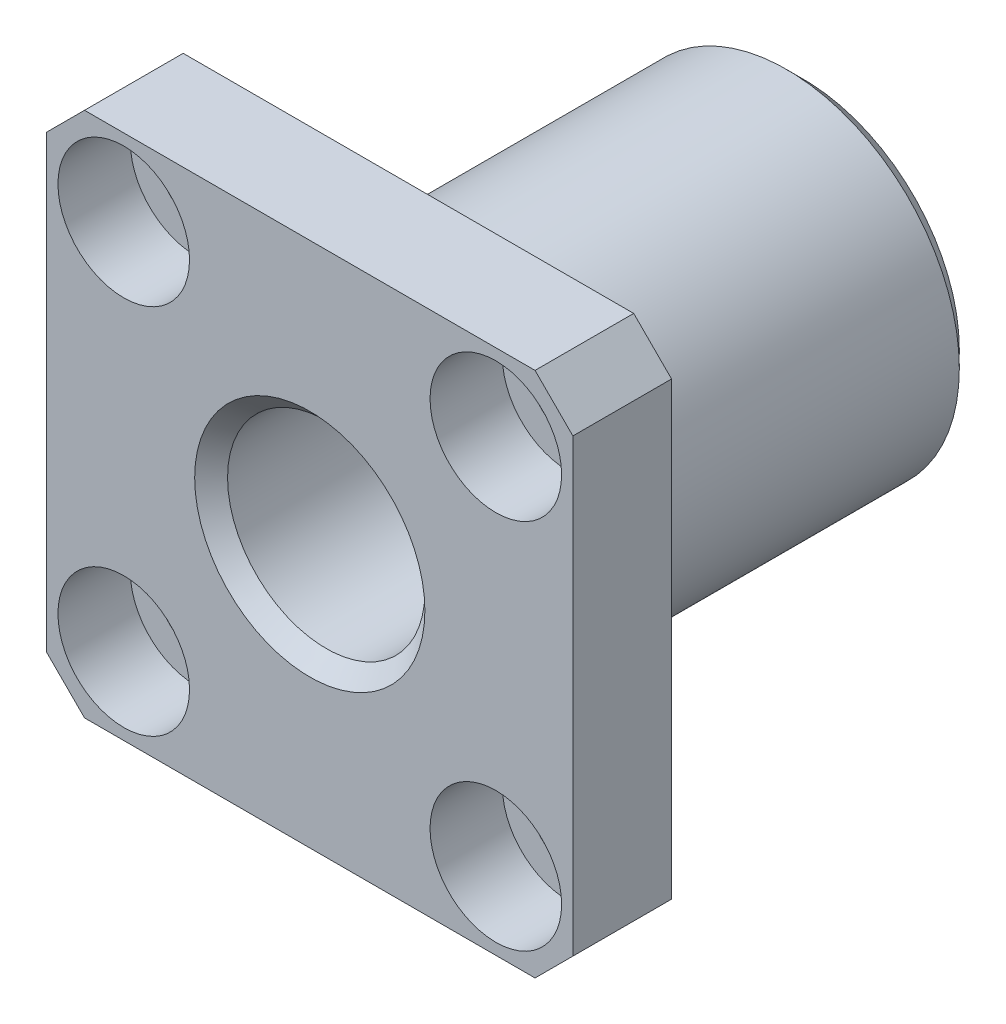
ISO-10303-21;
HEADER;
FILE_DESCRIPTION(('STEP AP214'),'2;1');
FILE_NAME('part.step','',(''),(''),'','','');
FILE_SCHEMA(('AUTOMOTIVE_DESIGN { 1 0 10303 214 1 1 1 1 }'));
ENDSEC;
DATA;
#1=APPLICATION_CONTEXT('core data for automotive mechanical design processes');
#2=APPLICATION_PROTOCOL_DEFINITION('international standard','automotive_design',2000,#1);
#3=PRODUCT_CONTEXT('',#1,'mechanical');
#4=PRODUCT('Part','Part','',(#3));
#5=PRODUCT_RELATED_PRODUCT_CATEGORY('part','',(#4));
#6=PRODUCT_DEFINITION_FORMATION('','',#4);
#7=PRODUCT_DEFINITION_CONTEXT('part definition',#1,'design');
#8=PRODUCT_DEFINITION('design','',#6,#7);
#9=PRODUCT_DEFINITION_SHAPE('','',#8);
#10=(LENGTH_UNIT() NAMED_UNIT(*) SI_UNIT(.MILLI.,.METRE.));
#11=(NAMED_UNIT(*) PLANE_ANGLE_UNIT() SI_UNIT($,.RADIAN.));
#12=(NAMED_UNIT(*) SI_UNIT($,.STERADIAN.) SOLID_ANGLE_UNIT());
#13=UNCERTAINTY_MEASURE_WITH_UNIT(LENGTH_MEASURE(1.E-05),#10,'distance_accuracy_value','');
#14=(GEOMETRIC_REPRESENTATION_CONTEXT(3) GLOBAL_UNCERTAINTY_ASSIGNED_CONTEXT((#13)) GLOBAL_UNIT_ASSIGNED_CONTEXT((#10,
#11,#12)) REPRESENTATION_CONTEXT('',''));
#15=CARTESIAN_POINT('',(0.,0.,0.));
#16=DIRECTION('',(0.,0.,1.));
#17=DIRECTION('',(1.,0.,0.));
#18=AXIS2_PLACEMENT_3D('',#15,#16,#17);
#19=CARTESIAN_POINT('',(0.,0.,29.));
#20=DIRECTION('',(0.,0.,1.));
#21=DIRECTION('',(1.,0.,0.));
#22=AXIS2_PLACEMENT_3D('',#19,#20,#21);
#23=CONICAL_SURFACE('',#22,6.,0.785398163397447);
#24=CARTESIAN_POINT('',(0.,0.,29.));
#25=DIRECTION('',(0.,0.,1.));
#26=DIRECTION('',(1.,0.,0.));
#27=AXIS2_PLACEMENT_3D('',#24,#25,#26);
#28=CIRCLE('',#27,6.);
#29=CARTESIAN_POINT('',(6.,0.,29.));
#30=VERTEX_POINT('',#29);
#31=CARTESIAN_POINT('',(-6.,0.,29.));
#32=VERTEX_POINT('',#31);
#33=EDGE_CURVE('E37',#30,#32,#28,.T.);
#34=ORIENTED_EDGE('',*,*,#33,.F.);
#35=CARTESIAN_POINT('',(0.,0.,29.));
#36=DIRECTION('',(0.,0.,1.));
#37=DIRECTION('',(1.,0.,0.));
#38=AXIS2_PLACEMENT_3D('',#35,#36,#37);
#39=CIRCLE('',#38,6.);
#40=EDGE_CURVE('E373',#32,#30,#39,.T.);
#41=ORIENTED_EDGE('',*,*,#40,.F.);
#42=DIRECTION('',(-0.707106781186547,0.,0.707106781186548));
#43=VECTOR('',#42,1.);
#44=CARTESIAN_POINT('',(-6.,0.,29.));
#45=LINE('',#44,#43);
#46=CARTESIAN_POINT('',(-7.,0.,30.));
#47=VERTEX_POINT('',#46);
#48=EDGE_CURVE('E9',#32,#47,#45,.T.);
#49=ORIENTED_EDGE('',*,*,#48,.T.);
#50=CARTESIAN_POINT('',(0.,0.,30.));
#51=DIRECTION('',(0.,0.,-1.));
#52=DIRECTION('',(1.,0.,0.));
#53=AXIS2_PLACEMENT_3D('',#50,#51,#52);
#54=CIRCLE('',#53,7.);
#55=CARTESIAN_POINT('',(7.,0.,30.));
#56=VERTEX_POINT('',#55);
#57=EDGE_CURVE('E311',#56,#47,#54,.T.);
#58=ORIENTED_EDGE('',*,*,#57,.F.);
#59=CARTESIAN_POINT('',(0.,0.,30.));
#60=DIRECTION('',(0.,0.,-1.));
#61=DIRECTION('',(1.,0.,0.));
#62=AXIS2_PLACEMENT_3D('',#59,#60,#61);
#63=CIRCLE('',#62,7.);
#64=EDGE_CURVE('E315',#47,#56,#63,.T.);
#65=ORIENTED_EDGE('',*,*,#64,.F.);
#66=ORIENTED_EDGE('',*,*,#48,.F.);
#67=EDGE_LOOP('',(#34,#41,#49,#58,#65,#66));
#68=FACE_BOUND('',#67,.T.);
#69=ADVANCED_FACE('F15',(#68),#23,.F.);
#70=CARTESIAN_POINT('',(0.,0.,1.));
#71=DIRECTION('',(0.,0.,1.));
#72=DIRECTION('',(1.,0.,0.));
#73=AXIS2_PLACEMENT_3D('',#70,#71,#72);
#74=CONICAL_SURFACE('',#73,10.5,0.785398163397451);
#75=CARTESIAN_POINT('',(0.,0.,1.));
#76=DIRECTION('',(0.,0.,1.));
#77=DIRECTION('',(1.,0.,0.));
#78=AXIS2_PLACEMENT_3D('',#75,#76,#77);
#79=CIRCLE('',#78,10.5);
#80=CARTESIAN_POINT('',(10.5,0.,1.));
#81=VERTEX_POINT('',#80);
#82=CARTESIAN_POINT('',(-10.5,0.,1.00000000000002));
#83=VERTEX_POINT('',#82);
#84=EDGE_CURVE('E1086',#81,#83,#79,.T.);
#85=ORIENTED_EDGE('',*,*,#84,.F.);
#86=CARTESIAN_POINT('',(0.,0.,1.));
#87=DIRECTION('',(0.,0.,1.));
#88=DIRECTION('',(1.,0.,0.));
#89=AXIS2_PLACEMENT_3D('',#86,#87,#88);
#90=CIRCLE('',#89,10.5);
#91=EDGE_CURVE('E403',#83,#81,#90,.T.);
#92=ORIENTED_EDGE('',*,*,#91,.F.);
#93=DIRECTION('',(0.707106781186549,0.,-0.707106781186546));
#94=VECTOR('',#93,1.);
#95=CARTESIAN_POINT('',(-10.5,0.,1.));
#96=LINE('',#95,#94);
#97=CARTESIAN_POINT('',(-9.5,0.,0.));
#98=VERTEX_POINT('',#97);
#99=EDGE_CURVE('E24',#83,#98,#96,.T.);
#100=ORIENTED_EDGE('',*,*,#99,.T.);
#101=CARTESIAN_POINT('',(0.,0.,0.));
#102=DIRECTION('',(0.,0.,-1.));
#103=DIRECTION('',(1.,0.,0.));
#104=AXIS2_PLACEMENT_3D('',#101,#102,#103);
#105=CIRCLE('',#104,9.5);
#106=CARTESIAN_POINT('',(9.5,0.,0.));
#107=VERTEX_POINT('',#106);
#108=EDGE_CURVE('E400',#107,#98,#105,.T.);
#109=ORIENTED_EDGE('',*,*,#108,.F.);
#110=CARTESIAN_POINT('',(0.,0.,0.));
#111=DIRECTION('',(0.,0.,-1.));
#112=DIRECTION('',(1.,0.,0.));
#113=AXIS2_PLACEMENT_3D('',#110,#111,#112);
#114=CIRCLE('',#113,9.5);
#115=EDGE_CURVE('E409',#98,#107,#114,.T.);
#116=ORIENTED_EDGE('',*,*,#115,.F.);
#117=ORIENTED_EDGE('',*,*,#99,.F.);
#118=EDGE_LOOP('',(#85,#92,#100,#109,#116,#117));
#119=FACE_BOUND('',#118,.T.);
#120=ADVANCED_FACE('F397',(#119),#74,.T.);
#121=CARTESIAN_POINT('',(0.,0.,0.));
#122=DIRECTION('',(0.,0.,1.));
#123=DIRECTION('',(1.,0.,0.));
#124=AXIS2_PLACEMENT_3D('',#121,#122,#123);
#125=CYLINDRICAL_SURFACE('',#124,6.);
#126=CARTESIAN_POINT('',(0.,0.,0.));
#127=DIRECTION('',(0.,0.,1.));
#128=DIRECTION('',(1.,0.,0.));
#129=AXIS2_PLACEMENT_3D('',#126,#127,#128);
#130=CIRCLE('',#129,6.);
#131=CARTESIAN_POINT('',(6.,0.,0.));
#132=VERTEX_POINT('',#131);
#133=CARTESIAN_POINT('',(-6.,0.,0.));
#134=VERTEX_POINT('',#133);
#135=EDGE_CURVE('E412',#132,#134,#130,.T.);
#136=ORIENTED_EDGE('',*,*,#135,.F.);
#137=CARTESIAN_POINT('',(0.,0.,0.));
#138=DIRECTION('',(0.,0.,1.));
#139=DIRECTION('',(1.,0.,0.));
#140=AXIS2_PLACEMENT_3D('',#137,#138,#139);
#141=CIRCLE('',#140,6.);
#142=EDGE_CURVE('E431',#134,#132,#141,.T.);
#143=ORIENTED_EDGE('',*,*,#142,.F.);
#144=DIRECTION('',(0.,0.,1.));
#145=VECTOR('',#144,1.);
#146=CARTESIAN_POINT('',(-6.,0.,0.));
#147=LINE('',#146,#145);
#148=EDGE_CURVE('E376',#134,#32,#147,.T.);
#149=ORIENTED_EDGE('',*,*,#148,.T.);
#150=ORIENTED_EDGE('',*,*,#40,.T.);
#151=ORIENTED_EDGE('',*,*,#33,.T.);
#152=ORIENTED_EDGE('',*,*,#148,.F.);
#153=EDGE_LOOP('',(#136,#143,#149,#150,#151,#152));
#154=FACE_BOUND('',#153,.T.);
#155=ADVANCED_FACE('F586',(#154),#125,.F.);
#156=CARTESIAN_POINT('',(-11.3137084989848,11.3137084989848,30.));
#157=DIRECTION('',(0.,0.,1.));
#158=DIRECTION('',(1.,0.,0.));
#159=AXIS2_PLACEMENT_3D('',#156,#157,#158);
#160=CYLINDRICAL_SURFACE('',#159,4.);
#161=CARTESIAN_POINT('',(-11.3137084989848,11.3137084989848,25.6));
#162=DIRECTION('',(0.,0.,1.));
#163=DIRECTION('',(1.,0.,0.));
#164=AXIS2_PLACEMENT_3D('',#161,#162,#163);
#165=CIRCLE('',#164,4.);
#166=CARTESIAN_POINT('',(-7.31370849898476,11.3137084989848,25.6));
#167=VERTEX_POINT('',#166);
#168=CARTESIAN_POINT('',(-15.3137084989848,11.3137084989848,25.6));
#169=VERTEX_POINT('',#168);
#170=EDGE_CURVE('E235',#167,#169,#165,.T.);
#171=ORIENTED_EDGE('',*,*,#170,.F.);
#172=CARTESIAN_POINT('',(-11.3137084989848,11.3137084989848,25.6));
#173=DIRECTION('',(0.,0.,1.));
#174=DIRECTION('',(1.,0.,0.));
#175=AXIS2_PLACEMENT_3D('',#172,#173,#174);
#176=CIRCLE('',#175,4.);
#177=EDGE_CURVE('E239',#169,#167,#176,.T.);
#178=ORIENTED_EDGE('',*,*,#177,.F.);
#179=DIRECTION('',(0.,0.,1.));
#180=VECTOR('',#179,1.);
#181=CARTESIAN_POINT('',(-15.3137084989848,11.3137084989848,30.));
#182=LINE('',#181,#180);
#183=CARTESIAN_POINT('',(-15.3137084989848,11.3137084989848,30.));
#184=VERTEX_POINT('',#183);
#185=EDGE_CURVE('E379',#169,#184,#182,.T.);
#186=ORIENTED_EDGE('',*,*,#185,.T.);
#187=CARTESIAN_POINT('',(-11.3137084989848,11.3137084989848,30.));
#188=DIRECTION('',(0.,0.,1.));
#189=DIRECTION('',(1.,0.,0.));
#190=AXIS2_PLACEMENT_3D('',#187,#188,#189);
#191=CIRCLE('',#190,4.);
#192=CARTESIAN_POINT('',(-7.31370849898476,11.3137084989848,30.));
#193=VERTEX_POINT('',#192);
#194=EDGE_CURVE('E249',#184,#193,#191,.T.);
#195=ORIENTED_EDGE('',*,*,#194,.T.);
#196=CARTESIAN_POINT('',(-11.3137084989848,11.3137084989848,30.));
#197=DIRECTION('',(0.,0.,1.));
#198=DIRECTION('',(1.,0.,0.));
#199=AXIS2_PLACEMENT_3D('',#196,#197,#198);
#200=CIRCLE('',#199,4.);
#201=EDGE_CURVE('E316',#193,#184,#200,.T.);
#202=ORIENTED_EDGE('',*,*,#201,.T.);
#203=ORIENTED_EDGE('',*,*,#185,.F.);
#204=EDGE_LOOP('',(#171,#178,#186,#195,#202,#203));
#205=FACE_BOUND('',#204,.T.);
#206=ADVANCED_FACE('F593',(#205),#160,.F.);
#207=CARTESIAN_POINT('',(-9.06370849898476,11.3137084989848,25.6));
#208=DIRECTION('',(0.,0.,-1.));
#209=DIRECTION('',(0.,-1.,0.));
#210=AXIS2_PLACEMENT_3D('',#207,#208,#209);
#211=PLANE('',#210);
#212=CARTESIAN_POINT('',(-11.3137084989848,11.3137084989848,25.6));
#213=DIRECTION('',(0.,0.,1.));
#214=DIRECTION('',(1.,0.,0.));
#215=AXIS2_PLACEMENT_3D('',#212,#213,#214);
#216=CIRCLE('',#215,2.25);
#217=CARTESIAN_POINT('',(-9.06370849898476,11.3137084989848,25.6));
#218=VERTEX_POINT('',#217);
#219=CARTESIAN_POINT('',(-13.5637084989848,11.3137084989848,25.6));
#220=VERTEX_POINT('',#219);
#221=EDGE_CURVE('E240',#218,#220,#216,.T.);
#222=ORIENTED_EDGE('',*,*,#221,.F.);
#223=CARTESIAN_POINT('',(-11.3137084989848,11.3137084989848,25.6));
#224=DIRECTION('',(0.,0.,1.));
#225=DIRECTION('',(1.,0.,0.));
#226=AXIS2_PLACEMENT_3D('',#223,#224,#225);
#227=CIRCLE('',#226,2.25);
#228=EDGE_CURVE('E366',#220,#218,#227,.T.);
#229=ORIENTED_EDGE('',*,*,#228,.F.);
#230=EDGE_LOOP('',(#222,#229));
#231=FACE_BOUND('',#230,.T.);
#232=ORIENTED_EDGE('',*,*,#170,.T.);
#233=ORIENTED_EDGE('',*,*,#177,.T.);
#234=EDGE_LOOP('',(#232,#233));
#235=FACE_BOUND('',#234,.T.);
#236=ADVANCED_FACE('F598',(#231,#235),#211,.F.);
#237=CARTESIAN_POINT('',(-11.3137084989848,11.3137084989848,30.));
#238=DIRECTION('',(0.,0.,1.));
#239=DIRECTION('',(1.,0.,0.));
#240=AXIS2_PLACEMENT_3D('',#237,#238,#239);
#241=CYLINDRICAL_SURFACE('',#240,2.25);
#242=CARTESIAN_POINT('',(-11.3137084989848,11.3137084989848,24.));
#243=DIRECTION('',(0.,0.,-1.));
#244=DIRECTION('',(-1.,0.,0.));
#245=AXIS2_PLACEMENT_3D('',#242,#243,#244);
#246=CIRCLE('',#245,2.25);
#247=CARTESIAN_POINT('',(-13.5637084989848,11.3137084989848,24.));
#248=VERTEX_POINT('',#247);
#249=EDGE_CURVE('E284',#248,#248,#246,.T.);
#250=ORIENTED_EDGE('',*,*,#249,.T.);
#251=DIRECTION('',(0.,0.,1.));
#252=VECTOR('',#251,1.);
#253=CARTESIAN_POINT('',(-13.5637084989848,11.3137084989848,30.));
#254=LINE('',#253,#252);
#255=EDGE_CURVE('E362',#248,#220,#254,.T.);
#256=ORIENTED_EDGE('',*,*,#255,.T.);
#257=ORIENTED_EDGE('',*,*,#228,.T.);
#258=ORIENTED_EDGE('',*,*,#221,.T.);
#259=ORIENTED_EDGE('',*,*,#255,.F.);
#260=EDGE_LOOP('',(#250,#256,#257,#258,#259));
#261=FACE_BOUND('',#260,.T.);
#262=ADVANCED_FACE('F607',(#261),#241,.F.);
#263=CARTESIAN_POINT('',(11.3137084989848,11.3137084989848,30.));
#264=DIRECTION('',(0.,0.,1.));
#265=DIRECTION('',(1.,0.,0.));
#266=AXIS2_PLACEMENT_3D('',#263,#264,#265);
#267=CYLINDRICAL_SURFACE('',#266,4.);
#268=CARTESIAN_POINT('',(11.3137084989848,11.3137084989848,25.6));
#269=DIRECTION('',(0.,0.,1.));
#270=DIRECTION('',(1.,0.,0.));
#271=AXIS2_PLACEMENT_3D('',#268,#269,#270);
#272=CIRCLE('',#271,4.);
#273=CARTESIAN_POINT('',(15.3137084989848,11.3137084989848,25.6));
#274=VERTEX_POINT('',#273);
#275=CARTESIAN_POINT('',(7.31370849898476,11.3137084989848,25.6));
#276=VERTEX_POINT('',#275);
#277=EDGE_CURVE('E260',#274,#276,#272,.T.);
#278=ORIENTED_EDGE('',*,*,#277,.F.);
#279=CARTESIAN_POINT('',(11.3137084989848,11.3137084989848,25.6));
#280=DIRECTION('',(0.,0.,1.));
#281=DIRECTION('',(1.,0.,0.));
#282=AXIS2_PLACEMENT_3D('',#279,#280,#281);
#283=CIRCLE('',#282,4.);
#284=EDGE_CURVE('E143',#276,#274,#283,.T.);
#285=ORIENTED_EDGE('',*,*,#284,.F.);
#286=DIRECTION('',(0.,0.,1.));
#287=VECTOR('',#286,1.);
#288=CARTESIAN_POINT('',(7.31370849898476,11.3137084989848,30.));
#289=LINE('',#288,#287);
#290=CARTESIAN_POINT('',(7.31370849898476,11.3137084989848,30.));
#291=VERTEX_POINT('',#290);
#292=EDGE_CURVE('E359',#276,#291,#289,.T.);
#293=ORIENTED_EDGE('',*,*,#292,.T.);
#294=CARTESIAN_POINT('',(11.3137084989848,11.3137084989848,30.));
#295=DIRECTION('',(0.,0.,1.));
#296=DIRECTION('',(1.,0.,0.));
#297=AXIS2_PLACEMENT_3D('',#294,#295,#296);
#298=CIRCLE('',#297,4.);
#299=CARTESIAN_POINT('',(15.3137084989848,11.3137084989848,30.));
#300=VERTEX_POINT('',#299);
#301=EDGE_CURVE('E241',#291,#300,#298,.T.);
#302=ORIENTED_EDGE('',*,*,#301,.T.);
#303=CARTESIAN_POINT('',(11.3137084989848,11.3137084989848,30.));
#304=DIRECTION('',(0.,0.,1.));
#305=DIRECTION('',(1.,0.,0.));
#306=AXIS2_PLACEMENT_3D('',#303,#304,#305);
#307=CIRCLE('',#306,4.);
#308=EDGE_CURVE('E245',#300,#291,#307,.T.);
#309=ORIENTED_EDGE('',*,*,#308,.T.);
#310=ORIENTED_EDGE('',*,*,#292,.F.);
#311=EDGE_LOOP('',(#278,#285,#293,#302,#309,#310));
#312=FACE_BOUND('',#311,.T.);
#313=ADVANCED_FACE('F612',(#312),#267,.F.);
#314=CARTESIAN_POINT('',(13.5637084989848,11.3137084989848,25.6));
#315=DIRECTION('',(0.,0.,-1.));
#316=DIRECTION('',(0.,-1.,0.));
#317=AXIS2_PLACEMENT_3D('',#314,#315,#316);
#318=PLANE('',#317);
#319=CARTESIAN_POINT('',(11.3137084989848,11.3137084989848,25.6));
#320=DIRECTION('',(0.,0.,1.));
#321=DIRECTION('',(1.,0.,0.));
#322=AXIS2_PLACEMENT_3D('',#319,#320,#321);
#323=CIRCLE('',#322,2.25);
#324=CARTESIAN_POINT('',(13.5637084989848,11.3137084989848,25.6));
#325=VERTEX_POINT('',#324);
#326=CARTESIAN_POINT('',(9.06370849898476,11.3137084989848,25.6));
#327=VERTEX_POINT('',#326);
#328=EDGE_CURVE('E131',#325,#327,#323,.T.);
#329=ORIENTED_EDGE('',*,*,#328,.F.);
#330=CARTESIAN_POINT('',(11.3137084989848,11.3137084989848,25.6));
#331=DIRECTION('',(0.,0.,1.));
#332=DIRECTION('',(1.,0.,0.));
#333=AXIS2_PLACEMENT_3D('',#330,#331,#332);
#334=CIRCLE('',#333,2.25);
#335=EDGE_CURVE('E261',#327,#325,#334,.T.);
#336=ORIENTED_EDGE('',*,*,#335,.F.);
#337=EDGE_LOOP('',(#329,#336));
#338=FACE_BOUND('',#337,.T.);
#339=ORIENTED_EDGE('',*,*,#277,.T.);
#340=ORIENTED_EDGE('',*,*,#284,.T.);
#341=EDGE_LOOP('',(#339,#340));
#342=FACE_BOUND('',#341,.T.);
#343=ADVANCED_FACE('F624',(#338,#342),#318,.F.);
#344=CARTESIAN_POINT('',(11.3137084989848,11.3137084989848,30.));
#345=DIRECTION('',(0.,0.,1.));
#346=DIRECTION('',(1.,0.,0.));
#347=AXIS2_PLACEMENT_3D('',#344,#345,#346);
#348=CYLINDRICAL_SURFACE('',#347,2.25);
#349=CARTESIAN_POINT('',(11.3137084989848,11.3137084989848,24.));
#350=DIRECTION('',(0.,0.,-1.));
#351=DIRECTION('',(-1.,0.,0.));
#352=AXIS2_PLACEMENT_3D('',#349,#350,#351);
#353=CIRCLE('',#352,2.25);
#354=CARTESIAN_POINT('',(9.06370849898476,11.3137084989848,24.));
#355=VERTEX_POINT('',#354);
#356=EDGE_CURVE('E288',#355,#355,#353,.T.);
#357=ORIENTED_EDGE('',*,*,#356,.T.);
#358=DIRECTION('',(0.,0.,1.));
#359=VECTOR('',#358,1.);
#360=CARTESIAN_POINT('',(9.06370849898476,11.3137084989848,30.));
#361=LINE('',#360,#359);
#362=EDGE_CURVE('E303',#355,#327,#361,.T.);
#363=ORIENTED_EDGE('',*,*,#362,.T.);
#364=ORIENTED_EDGE('',*,*,#335,.T.);
#365=ORIENTED_EDGE('',*,*,#328,.T.);
#366=ORIENTED_EDGE('',*,*,#362,.F.);
#367=EDGE_LOOP('',(#357,#363,#364,#365,#366));
#368=FACE_BOUND('',#367,.T.);
#369=ADVANCED_FACE('F636',(#368),#348,.F.);
#370=CARTESIAN_POINT('',(11.3137084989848,-11.3137084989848,30.));
#371=DIRECTION('',(0.,0.,1.));
#372=DIRECTION('',(1.,0.,0.));
#373=AXIS2_PLACEMENT_3D('',#370,#371,#372);
#374=CYLINDRICAL_SURFACE('',#373,4.);
#375=CARTESIAN_POINT('',(11.3137084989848,-11.3137084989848,25.6));
#376=DIRECTION('',(0.,0.,1.));
#377=DIRECTION('',(1.,0.,0.));
#378=AXIS2_PLACEMENT_3D('',#375,#376,#377);
#379=CIRCLE('',#378,4.);
#380=CARTESIAN_POINT('',(15.3137084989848,-11.3137084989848,25.6));
#381=VERTEX_POINT('',#380);
#382=CARTESIAN_POINT('',(7.31370849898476,-11.3137084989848,25.6));
#383=VERTEX_POINT('',#382);
#384=EDGE_CURVE('E335',#381,#383,#379,.T.);
#385=ORIENTED_EDGE('',*,*,#384,.F.);
#386=CARTESIAN_POINT('',(11.3137084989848,-11.3137084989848,25.6));
#387=DIRECTION('',(0.,0.,1.));
#388=DIRECTION('',(1.,0.,0.));
#389=AXIS2_PLACEMENT_3D('',#386,#387,#388);
#390=CIRCLE('',#389,4.);
#391=EDGE_CURVE('E332',#383,#381,#390,.T.);
#392=ORIENTED_EDGE('',*,*,#391,.F.);
#393=DIRECTION('',(0.,0.,1.));
#394=VECTOR('',#393,1.);
#395=CARTESIAN_POINT('',(7.31370849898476,-11.3137084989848,30.));
#396=LINE('',#395,#394);
#397=CARTESIAN_POINT('',(7.31370849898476,-11.3137084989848,30.));
#398=VERTEX_POINT('',#397);
#399=EDGE_CURVE('E307',#383,#398,#396,.T.);
#400=ORIENTED_EDGE('',*,*,#399,.T.);
#401=CARTESIAN_POINT('',(11.3137084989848,-11.3137084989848,30.));
#402=DIRECTION('',(0.,0.,1.));
#403=DIRECTION('',(1.,0.,0.));
#404=AXIS2_PLACEMENT_3D('',#401,#402,#403);
#405=CIRCLE('',#404,4.);
#406=CARTESIAN_POINT('',(15.3137084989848,-11.3137084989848,30.));
#407=VERTEX_POINT('',#406);
#408=EDGE_CURVE('E265',#398,#407,#405,.T.);
#409=ORIENTED_EDGE('',*,*,#408,.T.);
#410=CARTESIAN_POINT('',(11.3137084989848,-11.3137084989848,30.));
#411=DIRECTION('',(0.,0.,1.));
#412=DIRECTION('',(1.,0.,0.));
#413=AXIS2_PLACEMENT_3D('',#410,#411,#412);
#414=CIRCLE('',#413,4.);
#415=EDGE_CURVE('E244',#407,#398,#414,.T.);
#416=ORIENTED_EDGE('',*,*,#415,.T.);
#417=ORIENTED_EDGE('',*,*,#399,.F.);
#418=EDGE_LOOP('',(#385,#392,#400,#409,#416,#417));
#419=FACE_BOUND('',#418,.T.);
#420=ADVANCED_FACE('F644',(#419),#374,.F.);
#421=CARTESIAN_POINT('',(13.5637084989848,-11.3137084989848,25.6));
#422=DIRECTION('',(0.,0.,-1.));
#423=DIRECTION('',(0.,-1.,0.));
#424=AXIS2_PLACEMENT_3D('',#421,#422,#423);
#425=PLANE('',#424);
#426=CARTESIAN_POINT('',(11.3137084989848,-11.3137084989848,25.6));
#427=DIRECTION('',(0.,0.,1.));
#428=DIRECTION('',(1.,0.,0.));
#429=AXIS2_PLACEMENT_3D('',#426,#427,#428);
#430=CIRCLE('',#429,2.25);
#431=CARTESIAN_POINT('',(13.5637084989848,-11.3137084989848,25.6));
#432=VERTEX_POINT('',#431);
#433=CARTESIAN_POINT('',(9.06370849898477,-11.3137084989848,25.6));
#434=VERTEX_POINT('',#433);
#435=EDGE_CURVE('E347',#432,#434,#430,.T.);
#436=ORIENTED_EDGE('',*,*,#435,.F.);
#437=CARTESIAN_POINT('',(11.3137084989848,-11.3137084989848,25.6));
#438=DIRECTION('',(0.,0.,1.));
#439=DIRECTION('',(1.,0.,0.));
#440=AXIS2_PLACEMENT_3D('',#437,#438,#439);
#441=CIRCLE('',#440,2.25);
#442=EDGE_CURVE('E343',#434,#432,#441,.T.);
#443=ORIENTED_EDGE('',*,*,#442,.F.);
#444=EDGE_LOOP('',(#436,#443));
#445=FACE_BOUND('',#444,.T.);
#446=ORIENTED_EDGE('',*,*,#384,.T.);
#447=ORIENTED_EDGE('',*,*,#391,.T.);
#448=EDGE_LOOP('',(#446,#447));
#449=FACE_BOUND('',#448,.T.);
#450=ADVANCED_FACE('F649',(#445,#449),#425,.F.);
#451=CARTESIAN_POINT('',(11.3137084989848,-11.3137084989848,30.));
#452=DIRECTION('',(0.,0.,1.));
#453=DIRECTION('',(1.,0.,0.));
#454=AXIS2_PLACEMENT_3D('',#451,#452,#453);
#455=CYLINDRICAL_SURFACE('',#454,2.25);
#456=CARTESIAN_POINT('',(11.3137084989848,-11.3137084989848,24.));
#457=DIRECTION('',(0.,0.,-1.));
#458=DIRECTION('',(-1.,0.,0.));
#459=AXIS2_PLACEMENT_3D('',#456,#457,#458);
#460=CIRCLE('',#459,2.25);
#461=CARTESIAN_POINT('',(9.06370849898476,-11.3137084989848,24.));
#462=VERTEX_POINT('',#461);
#463=EDGE_CURVE('E292',#462,#462,#460,.T.);
#464=ORIENTED_EDGE('',*,*,#463,.T.);
#465=DIRECTION('',(0.,0.,1.));
#466=VECTOR('',#465,1.);
#467=CARTESIAN_POINT('',(9.06370849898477,-11.3137084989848,30.));
#468=LINE('',#467,#466);
#469=EDGE_CURVE('E200',#462,#434,#468,.T.);
#470=ORIENTED_EDGE('',*,*,#469,.T.);
#471=ORIENTED_EDGE('',*,*,#442,.T.);
#472=ORIENTED_EDGE('',*,*,#435,.T.);
#473=ORIENTED_EDGE('',*,*,#469,.F.);
#474=EDGE_LOOP('',(#464,#470,#471,#472,#473));
#475=FACE_BOUND('',#474,.T.);
#476=ADVANCED_FACE('F661',(#475),#455,.F.);
#477=CARTESIAN_POINT('',(-11.3137084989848,-11.3137084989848,30.));
#478=DIRECTION('',(0.,0.,1.));
#479=DIRECTION('',(1.,0.,0.));
#480=AXIS2_PLACEMENT_3D('',#477,#478,#479);
#481=CYLINDRICAL_SURFACE('',#480,4.);
#482=CARTESIAN_POINT('',(-11.3137084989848,-11.3137084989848,25.6));
#483=DIRECTION('',(0.,0.,1.));
#484=DIRECTION('',(1.,0.,0.));
#485=AXIS2_PLACEMENT_3D('',#482,#483,#484);
#486=CIRCLE('',#485,4.);
#487=CARTESIAN_POINT('',(-7.31370849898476,-11.3137084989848,25.6));
#488=VERTEX_POINT('',#487);
#489=CARTESIAN_POINT('',(-15.3137084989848,-11.3137084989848,25.6));
#490=VERTEX_POINT('',#489);
#491=EDGE_CURVE('E327',#488,#490,#486,.T.);
#492=ORIENTED_EDGE('',*,*,#491,.F.);
#493=CARTESIAN_POINT('',(-11.3137084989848,-11.3137084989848,25.6));
#494=DIRECTION('',(0.,0.,1.));
#495=DIRECTION('',(1.,0.,0.));
#496=AXIS2_PLACEMENT_3D('',#493,#494,#495);
#497=CIRCLE('',#496,4.);
#498=EDGE_CURVE('E331',#490,#488,#497,.T.);
#499=ORIENTED_EDGE('',*,*,#498,.F.);
#500=DIRECTION('',(0.,0.,1.));
#501=VECTOR('',#500,1.);
#502=CARTESIAN_POINT('',(-15.3137084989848,-11.3137084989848,30.));
#503=LINE('',#502,#501);
#504=CARTESIAN_POINT('',(-15.3137084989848,-11.3137084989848,30.));
#505=VERTEX_POINT('',#504);
#506=EDGE_CURVE('E338',#490,#505,#503,.T.);
#507=ORIENTED_EDGE('',*,*,#506,.T.);
#508=CARTESIAN_POINT('',(-11.3137084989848,-11.3137084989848,30.));
#509=DIRECTION('',(0.,0.,1.));
#510=DIRECTION('',(1.,0.,0.));
#511=AXIS2_PLACEMENT_3D('',#508,#509,#510);
#512=CIRCLE('',#511,4.);
#513=CARTESIAN_POINT('',(-7.31370849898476,-11.3137084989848,30.));
#514=VERTEX_POINT('',#513);
#515=EDGE_CURVE('E216',#505,#514,#512,.T.);
#516=ORIENTED_EDGE('',*,*,#515,.T.);
#517=CARTESIAN_POINT('',(-11.3137084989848,-11.3137084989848,30.));
#518=DIRECTION('',(0.,0.,1.));
#519=DIRECTION('',(1.,0.,0.));
#520=AXIS2_PLACEMENT_3D('',#517,#518,#519);
#521=CIRCLE('',#520,4.);
#522=EDGE_CURVE('E224',#514,#505,#521,.T.);
#523=ORIENTED_EDGE('',*,*,#522,.T.);
#524=ORIENTED_EDGE('',*,*,#506,.F.);
#525=EDGE_LOOP('',(#492,#499,#507,#516,#523,#524));
#526=FACE_BOUND('',#525,.T.);
#527=ADVANCED_FACE('F673',(#526),#481,.F.);
#528=CARTESIAN_POINT('',(-9.06370849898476,-11.3137084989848,25.6));
#529=DIRECTION('',(0.,0.,-1.));
#530=DIRECTION('',(0.,-1.,0.));
#531=AXIS2_PLACEMENT_3D('',#528,#529,#530);
#532=PLANE('',#531);
#533=CARTESIAN_POINT('',(-11.3137084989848,-11.3137084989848,25.6));
#534=DIRECTION('',(0.,0.,1.));
#535=DIRECTION('',(1.,0.,0.));
#536=AXIS2_PLACEMENT_3D('',#533,#534,#535);
#537=CIRCLE('',#536,2.25);
#538=CARTESIAN_POINT('',(-9.06370849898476,-11.3137084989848,25.6));
#539=VERTEX_POINT('',#538);
#540=CARTESIAN_POINT('',(-13.5637084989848,-11.3137084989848,25.6));
#541=VERTEX_POINT('',#540);
#542=EDGE_CURVE('E212',#539,#541,#537,.T.);
#543=ORIENTED_EDGE('',*,*,#542,.F.);
#544=CARTESIAN_POINT('',(-11.3137084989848,-11.3137084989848,25.6));
#545=DIRECTION('',(0.,0.,1.));
#546=DIRECTION('',(1.,0.,0.));
#547=AXIS2_PLACEMENT_3D('',#544,#545,#546);
#548=CIRCLE('',#547,2.25);
#549=EDGE_CURVE('E215',#541,#539,#548,.T.);
#550=ORIENTED_EDGE('',*,*,#549,.F.);
#551=EDGE_LOOP('',(#543,#550));
#552=FACE_BOUND('',#551,.T.);
#553=ORIENTED_EDGE('',*,*,#491,.T.);
#554=ORIENTED_EDGE('',*,*,#498,.T.);
#555=EDGE_LOOP('',(#553,#554));
#556=FACE_BOUND('',#555,.T.);
#557=ADVANCED_FACE('F684',(#552,#556),#532,.F.);
#558=CARTESIAN_POINT('',(-11.3137084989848,-11.3137084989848,30.));
#559=DIRECTION('',(0.,0.,1.));
#560=DIRECTION('',(1.,0.,0.));
#561=AXIS2_PLACEMENT_3D('',#558,#559,#560);
#562=CYLINDRICAL_SURFACE('',#561,2.25);
#563=CARTESIAN_POINT('',(-11.3137084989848,-11.3137084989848,24.));
#564=DIRECTION('',(0.,0.,-1.));
#565=DIRECTION('',(-1.,0.,0.));
#566=AXIS2_PLACEMENT_3D('',#563,#564,#565);
#567=CIRCLE('',#566,2.25);
#568=CARTESIAN_POINT('',(-13.5637084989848,-11.3137084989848,24.));
#569=VERTEX_POINT('',#568);
#570=EDGE_CURVE('E210',#569,#569,#567,.T.);
#571=ORIENTED_EDGE('',*,*,#570,.T.);
#572=DIRECTION('',(0.,0.,1.));
#573=VECTOR('',#572,1.);
#574=CARTESIAN_POINT('',(-13.5637084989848,-11.3137084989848,30.));
#575=LINE('',#574,#573);
#576=EDGE_CURVE('E207',#569,#541,#575,.T.);
#577=ORIENTED_EDGE('',*,*,#576,.T.);
#578=ORIENTED_EDGE('',*,*,#549,.T.);
#579=ORIENTED_EDGE('',*,*,#542,.T.);
#580=ORIENTED_EDGE('',*,*,#576,.F.);
#581=EDGE_LOOP('',(#571,#577,#578,#579,#580));
#582=FACE_BOUND('',#581,.T.);
#583=ADVANCED_FACE('F208',(#582),#562,.F.);
#584=CARTESIAN_POINT('',(-16.,-13.698484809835,0.));
#585=DIRECTION('',(0.707106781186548,0.707106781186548,0.));
#586=DIRECTION('',(0.,0.,-1.));
#587=AXIS2_PLACEMENT_3D('',#584,#585,#586);
#588=PLANE('',#587);
#589=DIRECTION('',(0.707106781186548,-0.707106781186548,0.));
#590=VECTOR('',#589,1.);
#591=CARTESIAN_POINT('',(-16.,-13.698484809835,24.));
#592=LINE('',#591,#590);
#593=CARTESIAN_POINT('',(-16.,-13.698484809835,24.));
#594=VERTEX_POINT('',#593);
#595=CARTESIAN_POINT('',(-13.698484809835,-16.,24.));
#596=VERTEX_POINT('',#595);
#597=EDGE_CURVE('E277',#594,#596,#592,.T.);
#598=ORIENTED_EDGE('',*,*,#597,.T.);
#599=DIRECTION('',(0.,0.,1.));
#600=VECTOR('',#599,1.);
#601=CARTESIAN_POINT('',(-13.698484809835,-16.,24.));
#602=LINE('',#601,#600);
#603=CARTESIAN_POINT('',(-13.698484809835,-16.,30.));
#604=VERTEX_POINT('',#603);
#605=EDGE_CURVE('E456',#596,#604,#602,.T.);
#606=ORIENTED_EDGE('',*,*,#605,.T.);
#607=DIRECTION('',(-0.707106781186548,0.707106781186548,0.));
#608=VECTOR('',#607,1.);
#609=CARTESIAN_POINT('',(-13.698484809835,-16.,30.));
#610=LINE('',#609,#608);
#611=CARTESIAN_POINT('',(-16.,-13.698484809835,30.));
#612=VERTEX_POINT('',#611);
#613=EDGE_CURVE('E291',#604,#612,#610,.T.);
#614=ORIENTED_EDGE('',*,*,#613,.T.);
#615=DIRECTION('',(0.,0.,1.));
#616=VECTOR('',#615,1.);
#617=CARTESIAN_POINT('',(-16.,-13.698484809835,24.));
#618=LINE('',#617,#616);
#619=EDGE_CURVE('E468',#594,#612,#618,.T.);
#620=ORIENTED_EDGE('',*,*,#619,.F.);
#621=EDGE_LOOP('',(#598,#606,#614,#620));
#622=FACE_BOUND('',#621,.T.);
#623=ADVANCED_FACE('F498',(#622),#588,.F.);
#624=CARTESIAN_POINT('',(16.,-13.698484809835,0.));
#625=DIRECTION('',(-0.707106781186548,0.707106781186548,0.));
#626=DIRECTION('',(0.,0.,1.));
#627=AXIS2_PLACEMENT_3D('',#624,#625,#626);
#628=PLANE('',#627);
#629=DIRECTION('',(0.707106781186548,0.707106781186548,0.));
#630=VECTOR('',#629,1.);
#631=CARTESIAN_POINT('',(13.698484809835,-16.,24.));
#632=LINE('',#631,#630);
#633=CARTESIAN_POINT('',(13.698484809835,-16.,24.));
#634=VERTEX_POINT('',#633);
#635=CARTESIAN_POINT('',(16.,-13.698484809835,24.));
#636=VERTEX_POINT('',#635);
#637=EDGE_CURVE('E282',#634,#636,#632,.T.);
#638=ORIENTED_EDGE('',*,*,#637,.T.);
#639=DIRECTION('',(0.,0.,1.));
#640=VECTOR('',#639,1.);
#641=CARTESIAN_POINT('',(16.,-13.698484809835,24.));
#642=LINE('',#641,#640);
#643=CARTESIAN_POINT('',(16.,-13.698484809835,30.));
#644=VERTEX_POINT('',#643);
#645=EDGE_CURVE('E434',#636,#644,#642,.T.);
#646=ORIENTED_EDGE('',*,*,#645,.T.);
#647=DIRECTION('',(-0.707106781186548,-0.707106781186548,0.));
#648=VECTOR('',#647,1.);
#649=CARTESIAN_POINT('',(16.,-13.698484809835,30.));
#650=LINE('',#649,#648);
#651=CARTESIAN_POINT('',(13.698484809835,-16.,30.));
#652=VERTEX_POINT('',#651);
#653=EDGE_CURVE('E298',#644,#652,#650,.T.);
#654=ORIENTED_EDGE('',*,*,#653,.T.);
#655=DIRECTION('',(0.,0.,1.));
#656=VECTOR('',#655,1.);
#657=CARTESIAN_POINT('',(13.698484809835,-16.,24.));
#658=LINE('',#657,#656);
#659=EDGE_CURVE('E457',#634,#652,#658,.T.);
#660=ORIENTED_EDGE('',*,*,#659,.F.);
#661=EDGE_LOOP('',(#638,#646,#654,#660));
#662=FACE_BOUND('',#661,.T.);
#663=ADVANCED_FACE('F713',(#662),#628,.F.);
#664=CARTESIAN_POINT('',(16.,13.698484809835,0.));
#665=DIRECTION('',(-0.707106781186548,-0.707106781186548,0.));
#666=DIRECTION('',(-0.707106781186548,0.707106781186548,0.));
#667=AXIS2_PLACEMENT_3D('',#664,#665,#666);
#668=PLANE('',#667);
#669=DIRECTION('',(-0.707106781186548,0.707106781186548,0.));
#670=VECTOR('',#669,1.);
#671=CARTESIAN_POINT('',(16.,13.698484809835,24.));
#672=LINE('',#671,#670);
#673=CARTESIAN_POINT('',(16.,13.698484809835,24.));
#674=VERTEX_POINT('',#673);
#675=CARTESIAN_POINT('',(13.698484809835,16.,24.));
#676=VERTEX_POINT('',#675);
#677=EDGE_CURVE('E278',#674,#676,#672,.T.);
#678=ORIENTED_EDGE('',*,*,#677,.T.);
#679=DIRECTION('',(0.,0.,1.));
#680=VECTOR('',#679,1.);
#681=CARTESIAN_POINT('',(13.698484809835,16.,24.));
#682=LINE('',#681,#680);
#683=CARTESIAN_POINT('',(13.698484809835,16.,30.));
#684=VERTEX_POINT('',#683);
#685=EDGE_CURVE('E253',#676,#684,#682,.T.);
#686=ORIENTED_EDGE('',*,*,#685,.T.);
#687=DIRECTION('',(0.707106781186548,-0.707106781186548,0.));
#688=VECTOR('',#687,1.);
#689=CARTESIAN_POINT('',(13.698484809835,16.,30.));
#690=LINE('',#689,#688);
#691=CARTESIAN_POINT('',(16.,13.698484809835,30.));
#692=VERTEX_POINT('',#691);
#693=EDGE_CURVE('E302',#684,#692,#690,.T.);
#694=ORIENTED_EDGE('',*,*,#693,.T.);
#695=DIRECTION('',(0.,0.,1.));
#696=VECTOR('',#695,1.);
#697=CARTESIAN_POINT('',(16.,13.698484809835,24.));
#698=LINE('',#697,#696);
#699=EDGE_CURVE('E442',#674,#692,#698,.T.);
#700=ORIENTED_EDGE('',*,*,#699,.F.);
#701=EDGE_LOOP('',(#678,#686,#694,#700));
#702=FACE_BOUND('',#701,.T.);
#703=ADVANCED_FACE('F718',(#702),#668,.F.);
#704=CARTESIAN_POINT('',(-16.,13.698484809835,0.));
#705=DIRECTION('',(0.707106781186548,-0.707106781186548,0.));
#706=DIRECTION('',(0.,0.,-1.));
#707=AXIS2_PLACEMENT_3D('',#704,#705,#706);
#708=PLANE('',#707);
#709=DIRECTION('',(-0.707106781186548,-0.707106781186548,0.));
#710=VECTOR('',#709,1.);
#711=CARTESIAN_POINT('',(-13.698484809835,16.,24.));
#712=LINE('',#711,#710);
#713=CARTESIAN_POINT('',(-13.698484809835,16.,24.));
#714=VERTEX_POINT('',#713);
#715=CARTESIAN_POINT('',(-16.,13.698484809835,24.));
#716=VERTEX_POINT('',#715);
#717=EDGE_CURVE('E283',#714,#716,#712,.T.);
#718=ORIENTED_EDGE('',*,*,#717,.T.);
#719=DIRECTION('',(0.,0.,1.));
#720=VECTOR('',#719,1.);
#721=CARTESIAN_POINT('',(-16.,13.698484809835,24.));
#722=LINE('',#721,#720);
#723=CARTESIAN_POINT('',(-16.,13.698484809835,30.));
#724=VERTEX_POINT('',#723);
#725=EDGE_CURVE('E230',#716,#724,#722,.T.);
#726=ORIENTED_EDGE('',*,*,#725,.T.);
#727=DIRECTION('',(0.707106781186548,0.707106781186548,0.));
#728=VECTOR('',#727,1.);
#729=CARTESIAN_POINT('',(-16.,13.698484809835,30.));
#730=LINE('',#729,#728);
#731=CARTESIAN_POINT('',(-13.698484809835,16.,30.));
#732=VERTEX_POINT('',#731);
#733=EDGE_CURVE('E308',#724,#732,#730,.T.);
#734=ORIENTED_EDGE('',*,*,#733,.T.);
#735=DIRECTION('',(0.,0.,1.));
#736=VECTOR('',#735,1.);
#737=CARTESIAN_POINT('',(-13.698484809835,16.,24.));
#738=LINE('',#737,#736);
#739=EDGE_CURVE('E269',#714,#732,#738,.T.);
#740=ORIENTED_EDGE('',*,*,#739,.F.);
#741=EDGE_LOOP('',(#718,#726,#734,#740));
#742=FACE_BOUND('',#741,.T.);
#743=ADVANCED_FACE('F488',(#742),#708,.F.);
#744=CARTESIAN_POINT('',(0.,0.,30.));
#745=DIRECTION('',(0.,0.,1.));
#746=DIRECTION('',(1.,0.,0.));
#747=AXIS2_PLACEMENT_3D('',#744,#745,#746);
#748=PLANE('',#747);
#749=ORIENTED_EDGE('',*,*,#522,.F.);
#750=ORIENTED_EDGE('',*,*,#515,.F.);
#751=EDGE_LOOP('',(#749,#750));
#752=FACE_BOUND('',#751,.T.);
#753=ORIENTED_EDGE('',*,*,#415,.F.);
#754=ORIENTED_EDGE('',*,*,#408,.F.);
#755=EDGE_LOOP('',(#753,#754));
#756=FACE_BOUND('',#755,.T.);
#757=ORIENTED_EDGE('',*,*,#308,.F.);
#758=ORIENTED_EDGE('',*,*,#301,.F.);
#759=EDGE_LOOP('',(#757,#758));
#760=FACE_BOUND('',#759,.T.);
#761=ORIENTED_EDGE('',*,*,#201,.F.);
#762=ORIENTED_EDGE('',*,*,#194,.F.);
#763=EDGE_LOOP('',(#761,#762));
#764=FACE_BOUND('',#763,.T.);
#765=ORIENTED_EDGE('',*,*,#57,.T.);
#766=ORIENTED_EDGE('',*,*,#64,.T.);
#767=EDGE_LOOP('',(#765,#766));
#768=FACE_BOUND('',#767,.T.);
#769=ORIENTED_EDGE('',*,*,#613,.F.);
#770=DIRECTION('',(1.,0.,0.));
#771=VECTOR('',#770,1.);
#772=CARTESIAN_POINT('',(-13.698484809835,-16.,30.));
#773=LINE('',#772,#771);
#774=EDGE_CURVE('E461',#604,#652,#773,.T.);
#775=ORIENTED_EDGE('',*,*,#774,.T.);
#776=ORIENTED_EDGE('',*,*,#653,.F.);
#777=DIRECTION('',(0.,1.,0.));
#778=VECTOR('',#777,1.);
#779=CARTESIAN_POINT('',(16.,-13.698484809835,30.));
#780=LINE('',#779,#778);
#781=EDGE_CURVE('E448',#644,#692,#780,.T.);
#782=ORIENTED_EDGE('',*,*,#781,.T.);
#783=ORIENTED_EDGE('',*,*,#693,.F.);
#784=DIRECTION('',(-1.,0.,0.));
#785=VECTOR('',#784,1.);
#786=CARTESIAN_POINT('',(13.698484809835,16.,30.));
#787=LINE('',#786,#785);
#788=EDGE_CURVE('E273',#684,#732,#787,.T.);
#789=ORIENTED_EDGE('',*,*,#788,.T.);
#790=ORIENTED_EDGE('',*,*,#733,.F.);
#791=DIRECTION('',(0.,-1.,0.));
#792=VECTOR('',#791,1.);
#793=CARTESIAN_POINT('',(-16.,13.698484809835,30.));
#794=LINE('',#793,#792);
#795=EDGE_CURVE('E227',#724,#612,#794,.T.);
#796=ORIENTED_EDGE('',*,*,#795,.T.);
#797=EDGE_LOOP('',(#769,#775,#776,#782,#783,#789,#790,#796));
#798=FACE_BOUND('',#797,.T.);
#799=ADVANCED_FACE('F482',(#752,#756,#760,#764,#768,#798),#748,.T.);
#800=CARTESIAN_POINT('',(0.,0.,24.));
#801=DIRECTION('',(0.,0.,-1.));
#802=DIRECTION('',(0.,-1.,0.));
#803=AXIS2_PLACEMENT_3D('',#800,#801,#802);
#804=PLANE('',#803);
#805=ORIENTED_EDGE('',*,*,#570,.F.);
#806=EDGE_LOOP('',(#805));
#807=FACE_BOUND('',#806,.T.);
#808=ORIENTED_EDGE('',*,*,#463,.F.);
#809=EDGE_LOOP('',(#808));
#810=FACE_BOUND('',#809,.T.);
#811=ORIENTED_EDGE('',*,*,#356,.F.);
#812=EDGE_LOOP('',(#811));
#813=FACE_BOUND('',#812,.T.);
#814=ORIENTED_EDGE('',*,*,#249,.F.);
#815=EDGE_LOOP('',(#814));
#816=FACE_BOUND('',#815,.T.);
#817=CARTESIAN_POINT('',(0.,0.,24.));
#818=DIRECTION('',(0.,0.,-1.));
#819=DIRECTION('',(-1.,0.,0.));
#820=AXIS2_PLACEMENT_3D('',#817,#818,#819);
#821=CIRCLE('',#820,10.5);
#822=CARTESIAN_POINT('',(-10.5,0.,24.));
#823=VERTEX_POINT('',#822);
#824=CARTESIAN_POINT('',(10.5,0.,24.));
#825=VERTEX_POINT('',#824);
#826=EDGE_CURVE('E416',#823,#825,#821,.T.);
#827=ORIENTED_EDGE('',*,*,#826,.F.);
#828=CARTESIAN_POINT('',(0.,0.,24.));
#829=DIRECTION('',(0.,0.,-1.));
#830=DIRECTION('',(-1.,0.,0.));
#831=AXIS2_PLACEMENT_3D('',#828,#829,#830);
#832=CIRCLE('',#831,10.5);
#833=EDGE_CURVE('E422',#825,#823,#832,.T.);
#834=ORIENTED_EDGE('',*,*,#833,.F.);
#835=EDGE_LOOP('',(#827,#834));
#836=FACE_BOUND('',#835,.T.);
#837=ORIENTED_EDGE('',*,*,#597,.F.);
#838=DIRECTION('',(0.,-1.,0.));
#839=VECTOR('',#838,1.);
#840=CARTESIAN_POINT('',(-16.,13.698484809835,24.));
#841=LINE('',#840,#839);
#842=EDGE_CURVE('E234',#716,#594,#841,.T.);
#843=ORIENTED_EDGE('',*,*,#842,.F.);
#844=ORIENTED_EDGE('',*,*,#717,.F.);
#845=DIRECTION('',(-1.,0.,0.));
#846=VECTOR('',#845,1.);
#847=CARTESIAN_POINT('',(13.698484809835,16.,24.));
#848=LINE('',#847,#846);
#849=EDGE_CURVE('E257',#676,#714,#848,.T.);
#850=ORIENTED_EDGE('',*,*,#849,.F.);
#851=ORIENTED_EDGE('',*,*,#677,.F.);
#852=DIRECTION('',(0.,1.,0.));
#853=VECTOR('',#852,1.);
#854=CARTESIAN_POINT('',(16.,-13.698484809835,24.));
#855=LINE('',#854,#853);
#856=EDGE_CURVE('E438',#636,#674,#855,.T.);
#857=ORIENTED_EDGE('',*,*,#856,.F.);
#858=ORIENTED_EDGE('',*,*,#637,.F.);
#859=DIRECTION('',(1.,0.,0.));
#860=VECTOR('',#859,1.);
#861=CARTESIAN_POINT('',(-13.698484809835,-16.,24.));
#862=LINE('',#861,#860);
#863=EDGE_CURVE('E462',#596,#634,#862,.T.);
#864=ORIENTED_EDGE('',*,*,#863,.F.);
#865=EDGE_LOOP('',(#837,#843,#844,#850,#851,#857,#858,#864));
#866=FACE_BOUND('',#865,.T.);
#867=ADVANCED_FACE('F492',(#807,#810,#813,#816,#836,#866),#804,.T.);
#868=CARTESIAN_POINT('',(-16.,16.,24.));
#869=DIRECTION('',(0.,1.,0.));
#870=DIRECTION('',(1.,0.,0.));
#871=AXIS2_PLACEMENT_3D('',#868,#869,#870);
#872=PLANE('',#871);
#873=ORIENTED_EDGE('',*,*,#685,.F.);
#874=ORIENTED_EDGE('',*,*,#849,.T.);
#875=ORIENTED_EDGE('',*,*,#739,.T.);
#876=ORIENTED_EDGE('',*,*,#788,.F.);
#877=EDGE_LOOP('',(#873,#874,#875,#876));
#878=FACE_BOUND('',#877,.T.);
#879=ADVANCED_FACE('F783',(#878),#872,.T.);
#880=CARTESIAN_POINT('',(-16.,-16.,24.));
#881=DIRECTION('',(-1.,0.,0.));
#882=DIRECTION('',(0.,0.,1.));
#883=AXIS2_PLACEMENT_3D('',#880,#881,#882);
#884=PLANE('',#883);
#885=ORIENTED_EDGE('',*,*,#619,.T.);
#886=ORIENTED_EDGE('',*,*,#795,.F.);
#887=ORIENTED_EDGE('',*,*,#725,.F.);
#888=ORIENTED_EDGE('',*,*,#842,.T.);
#889=EDGE_LOOP('',(#885,#886,#887,#888));
#890=FACE_BOUND('',#889,.T.);
#891=ADVANCED_FACE('F485',(#890),#884,.T.);
#892=CARTESIAN_POINT('',(-16.,-16.,24.));
#893=DIRECTION('',(0.,-1.,0.));
#894=DIRECTION('',(0.,0.,-1.));
#895=AXIS2_PLACEMENT_3D('',#892,#893,#894);
#896=PLANE('',#895);
#897=ORIENTED_EDGE('',*,*,#605,.F.);
#898=ORIENTED_EDGE('',*,*,#863,.T.);
#899=ORIENTED_EDGE('',*,*,#659,.T.);
#900=ORIENTED_EDGE('',*,*,#774,.F.);
#901=EDGE_LOOP('',(#897,#898,#899,#900));
#902=FACE_BOUND('',#901,.T.);
#903=ADVANCED_FACE('F782',(#902),#896,.T.);
#904=CARTESIAN_POINT('',(16.,-16.,24.));
#905=DIRECTION('',(1.,0.,0.));
#906=DIRECTION('',(0.,1.,0.));
#907=AXIS2_PLACEMENT_3D('',#904,#905,#906);
#908=PLANE('',#907);
#909=ORIENTED_EDGE('',*,*,#645,.F.);
#910=ORIENTED_EDGE('',*,*,#856,.T.);
#911=ORIENTED_EDGE('',*,*,#699,.T.);
#912=ORIENTED_EDGE('',*,*,#781,.F.);
#913=EDGE_LOOP('',(#909,#910,#911,#912));
#914=FACE_BOUND('',#913,.T.);
#915=ADVANCED_FACE('F805',(#914),#908,.T.);
#916=CARTESIAN_POINT('',(0.,0.,0.));
#917=DIRECTION('',(0.,0.,1.));
#918=DIRECTION('',(1.,0.,0.));
#919=AXIS2_PLACEMENT_3D('',#916,#917,#918);
#920=PLANE('',#919);
#921=ORIENTED_EDGE('',*,*,#135,.T.);
#922=ORIENTED_EDGE('',*,*,#142,.T.);
#923=EDGE_LOOP('',(#921,#922));
#924=FACE_BOUND('',#923,.T.);
#925=ORIENTED_EDGE('',*,*,#108,.T.);
#926=ORIENTED_EDGE('',*,*,#115,.T.);
#927=EDGE_LOOP('',(#925,#926));
#928=FACE_BOUND('',#927,.T.);
#929=ADVANCED_FACE('F414',(#924,#928),#920,.F.);
#930=CARTESIAN_POINT('',(0.,0.,30.));
#931=DIRECTION('',(0.,0.,-1.));
#932=DIRECTION('',(-1.,0.,0.));
#933=AXIS2_PLACEMENT_3D('',#930,#931,#932);
#934=CYLINDRICAL_SURFACE('',#933,10.5);
#935=ORIENTED_EDGE('',*,*,#84,.T.);
#936=ORIENTED_EDGE('',*,*,#91,.T.);
#937=DIRECTION('',(0.,0.,1.));
#938=VECTOR('',#937,1.);
#939=CARTESIAN_POINT('',(10.5,0.,30.));
#940=LINE('',#939,#938);
#941=EDGE_CURVE('E1079',#81,#825,#940,.T.);
#942=ORIENTED_EDGE('',*,*,#941,.T.);
#943=ORIENTED_EDGE('',*,*,#833,.T.);
#944=ORIENTED_EDGE('',*,*,#826,.T.);
#945=ORIENTED_EDGE('',*,*,#941,.F.);
#946=EDGE_LOOP('',(#935,#936,#942,#943,#944,#945));
#947=FACE_BOUND('',#946,.T.);
#948=ADVANCED_FACE('F848',(#947),#934,.T.);
#949=CLOSED_SHELL('',(#69,#120,#155,#206,#236,#262,#313,#343,#369,#420,#450,#476,#527,#557,#583,
#623,#663,#703,#743,#799,#867,#879,#891,#903,#915,#929,#948));
#950=MANIFOLD_SOLID_BREP('B1',#949);
#951=ADVANCED_BREP_SHAPE_REPRESENTATION('',(#18,#950),#14);
#952=SHAPE_DEFINITION_REPRESENTATION(#9,#951);
ENDSEC;
END-ISO-10303-21;
